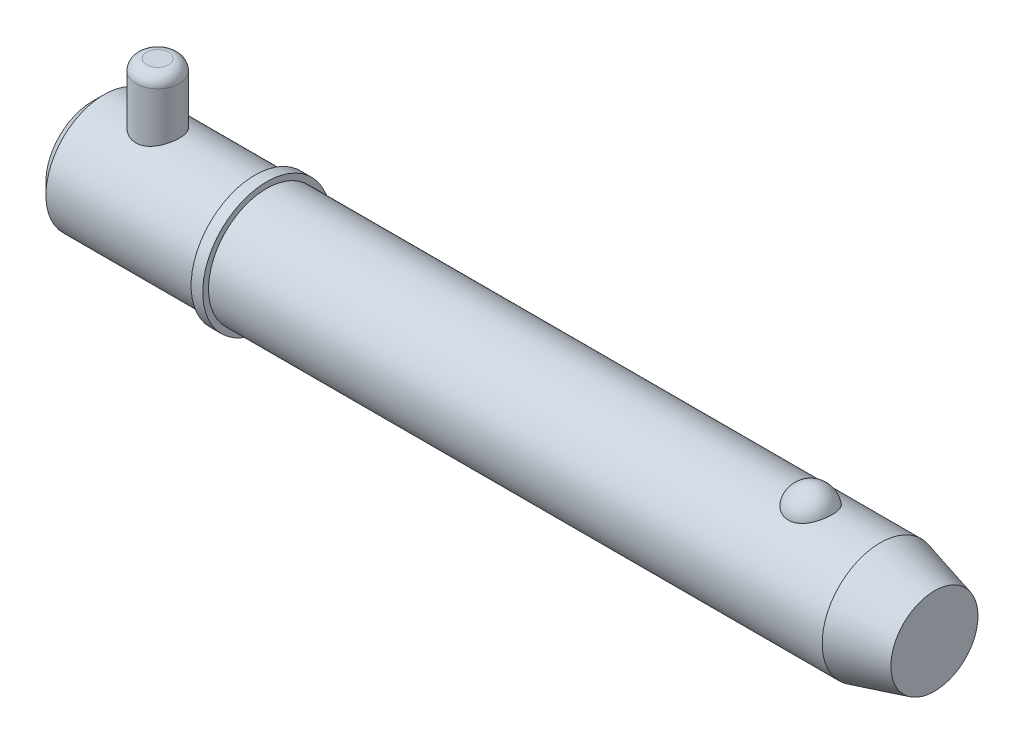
ISO-10303-21;
HEADER;
FILE_DESCRIPTION(('STEP AP214'),'2;1');
FILE_NAME('part.step','',(''),(''),'','','');
FILE_SCHEMA(('AUTOMOTIVE_DESIGN { 1 0 10303 214 1 1 1 1 }'));
ENDSEC;
DATA;
#1=APPLICATION_CONTEXT('core data for automotive mechanical design processes');
#2=APPLICATION_PROTOCOL_DEFINITION('international standard','automotive_design',2000,#1);
#3=PRODUCT_CONTEXT('',#1,'mechanical');
#4=PRODUCT('Part','Part','',(#3));
#5=PRODUCT_RELATED_PRODUCT_CATEGORY('part','',(#4));
#6=PRODUCT_DEFINITION_FORMATION('','',#4);
#7=PRODUCT_DEFINITION_CONTEXT('part definition',#1,'design');
#8=PRODUCT_DEFINITION('design','',#6,#7);
#9=PRODUCT_DEFINITION_SHAPE('','',#8);
#10=(LENGTH_UNIT() NAMED_UNIT(*) SI_UNIT(.MILLI.,.METRE.));
#11=(NAMED_UNIT(*) PLANE_ANGLE_UNIT() SI_UNIT($,.RADIAN.));
#12=(NAMED_UNIT(*) SI_UNIT($,.STERADIAN.) SOLID_ANGLE_UNIT());
#13=UNCERTAINTY_MEASURE_WITH_UNIT(LENGTH_MEASURE(1.E-05),#10,'distance_accuracy_value','');
#14=(GEOMETRIC_REPRESENTATION_CONTEXT(3) GLOBAL_UNCERTAINTY_ASSIGNED_CONTEXT((#13)) GLOBAL_UNIT_ASSIGNED_CONTEXT((#10,
#11,#12)) REPRESENTATION_CONTEXT('',''));
#15=CARTESIAN_POINT('',(0.,0.,0.));
#16=DIRECTION('',(0.,0.,1.));
#17=DIRECTION('',(1.,0.,0.));
#18=AXIS2_PLACEMENT_3D('',#15,#16,#17);
#19=CARTESIAN_POINT('',(14.28,25.4,0.));
#20=DIRECTION('',(0.,-1.,0.));
#21=DIRECTION('',(0.,0.,-1.));
#22=AXIS2_PLACEMENT_3D('',#19,#20,#21);
#23=CYLINDRICAL_SURFACE('',#22,4.76);
#24=CARTESIAN_POINT('',(14.28,-10.32,0.));
#25=DIRECTION('',(0.,1.,0.));
#26=DIRECTION('',(0.,0.,1.));
#27=AXIS2_PLACEMENT_3D('',#24,#25,#26);
#28=CIRCLE('',#27,4.76);
#29=CARTESIAN_POINT('',(14.28,-10.32,-4.76));
#30=VERTEX_POINT('',#29);
#31=EDGE_CURVE('P0_E25',#30,#30,#28,.T.);
#32=CARTESIAN_POINT('',(14.28,23.02,0.));
#33=DIRECTION('',(0.,1.,0.));
#34=DIRECTION('',(0.,0.,1.));
#35=AXIS2_PLACEMENT_3D('',#32,#33,#34);
#36=CIRCLE('',#35,4.76);
#37=CARTESIAN_POINT('',(14.28,23.02,-4.76));
#38=VERTEX_POINT('',#37);
#39=EDGE_CURVE('P0_E29',#38,#38,#36,.F.);
#40=CARTESIAN_POINT('',(14.28,-10.32,-4.76));
#41=CARTESIAN_POINT('',(14.28,-9.97270833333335,-4.76));
#42=CARTESIAN_POINT('',(14.28,-9.62541666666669,-4.76));
#43=CARTESIAN_POINT('',(14.28,-8.93083333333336,-4.76));
#44=CARTESIAN_POINT('',(14.28,-8.58354166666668,-4.76));
#45=CARTESIAN_POINT('',(14.28,-7.88895833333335,-4.76));
#46=CARTESIAN_POINT('',(14.28,-7.54166666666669,-4.76));
#47=CARTESIAN_POINT('',(14.28,-6.84708333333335,-4.76));
#48=CARTESIAN_POINT('',(14.28,-6.49979166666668,-4.76));
#49=CARTESIAN_POINT('',(14.28,-5.80520833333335,-4.76));
#50=CARTESIAN_POINT('',(14.28,-5.45791666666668,-4.76));
#51=CARTESIAN_POINT('',(14.28,-4.76333333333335,-4.76));
#52=CARTESIAN_POINT('',(14.28,-4.41604166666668,-4.76));
#53=CARTESIAN_POINT('',(14.28,-3.72145833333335,-4.76));
#54=CARTESIAN_POINT('',(14.28,-3.37416666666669,-4.76));
#55=CARTESIAN_POINT('',(14.28,-2.67958333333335,-4.76));
#56=CARTESIAN_POINT('',(14.28,-2.33229166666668,-4.76));
#57=CARTESIAN_POINT('',(14.28,-1.63770833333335,-4.76));
#58=CARTESIAN_POINT('',(14.28,-1.29041666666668,-4.76));
#59=CARTESIAN_POINT('',(14.28,-0.595833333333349,-4.76));
#60=CARTESIAN_POINT('',(14.28,-0.24854166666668,-4.76));
#61=CARTESIAN_POINT('',(14.28,0.446041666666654,-4.76));
#62=CARTESIAN_POINT('',(14.28,0.793333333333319,-4.76));
#63=CARTESIAN_POINT('',(14.28,1.48791666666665,-4.76));
#64=CARTESIAN_POINT('',(14.28,1.83520833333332,-4.76));
#65=CARTESIAN_POINT('',(14.28,2.52979166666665,-4.76));
#66=CARTESIAN_POINT('',(14.28,2.87708333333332,-4.76));
#67=CARTESIAN_POINT('',(14.28,3.57166666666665,-4.76));
#68=CARTESIAN_POINT('',(14.28,3.91895833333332,-4.76));
#69=CARTESIAN_POINT('',(14.28,4.61354166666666,-4.76));
#70=CARTESIAN_POINT('',(14.28,4.96083333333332,-4.76));
#71=CARTESIAN_POINT('',(14.28,5.65541666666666,-4.76));
#72=CARTESIAN_POINT('',(14.28,6.00270833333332,-4.76));
#73=CARTESIAN_POINT('',(14.28,6.69729166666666,-4.76));
#74=CARTESIAN_POINT('',(14.28,7.04458333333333,-4.76));
#75=CARTESIAN_POINT('',(14.28,7.73916666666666,-4.76));
#76=CARTESIAN_POINT('',(14.28,8.08645833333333,-4.76));
#77=CARTESIAN_POINT('',(14.28,8.78104166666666,-4.76));
#78=CARTESIAN_POINT('',(14.28,9.12833333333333,-4.76));
#79=CARTESIAN_POINT('',(14.28,9.82291666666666,-4.76));
#80=CARTESIAN_POINT('',(14.28,10.1702083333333,-4.76));
#81=CARTESIAN_POINT('',(14.28,10.8647916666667,-4.76));
#82=CARTESIAN_POINT('',(14.28,11.2120833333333,-4.76));
#83=CARTESIAN_POINT('',(14.28,11.9066666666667,-4.76));
#84=CARTESIAN_POINT('',(14.28,12.2539583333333,-4.76));
#85=CARTESIAN_POINT('',(14.28,12.9485416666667,-4.76));
#86=CARTESIAN_POINT('',(14.28,13.2958333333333,-4.76));
#87=CARTESIAN_POINT('',(14.28,13.9904166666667,-4.76));
#88=CARTESIAN_POINT('',(14.28,14.3377083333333,-4.76));
#89=CARTESIAN_POINT('',(14.28,15.0322916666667,-4.76));
#90=CARTESIAN_POINT('',(14.28,15.3795833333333,-4.76));
#91=CARTESIAN_POINT('',(14.28,16.0741666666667,-4.76));
#92=CARTESIAN_POINT('',(14.28,16.4214583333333,-4.76));
#93=CARTESIAN_POINT('',(14.28,17.1160416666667,-4.76));
#94=CARTESIAN_POINT('',(14.28,17.4633333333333,-4.76));
#95=CARTESIAN_POINT('',(14.28,18.1579166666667,-4.76));
#96=CARTESIAN_POINT('',(14.28,18.5052083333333,-4.76));
#97=CARTESIAN_POINT('',(14.28,19.1997916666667,-4.76));
#98=CARTESIAN_POINT('',(14.28,19.5470833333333,-4.76));
#99=CARTESIAN_POINT('',(14.28,20.2416666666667,-4.76));
#100=CARTESIAN_POINT('',(14.28,20.5889583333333,-4.76));
#101=CARTESIAN_POINT('',(14.28,21.2835416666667,-4.76));
#102=CARTESIAN_POINT('',(14.28,21.6308333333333,-4.76));
#103=CARTESIAN_POINT('',(14.28,22.3254166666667,-4.76));
#104=CARTESIAN_POINT('',(14.28,22.6727083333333,-4.76));
#105=CARTESIAN_POINT('',(14.28,23.02,-4.76));
#106=B_SPLINE_CURVE_WITH_KNOTS('',3,(#40,#41,#42,#43,#44,#45,#46,#47,#48,#49,#50,#51,#52,#53,
#54,#55,#56,#57,#58,#59,#60,#61,#62,#63,#64,#65,#66,#67,#68,#69,#70,#71,#72,#73,#74,#75,#76,#77,
#78,#79,#80,#81,#82,#83,#84,#85,#86,#87,#88,#89,#90,#91,#92,#93,#94,#95,#96,#97,#98,#99,#100,
#101,#102,#103,#104,#105),.UNSPECIFIED.,.F.,.F.,(4,2,2,2,2,2,2,2,2,2,2,2,2,2,2,2,2,2,2,2,2,2,2,
2,2,2,2,2,2,2,2,2,4),(0.,1.041875,2.08375,3.125625,4.1675,5.209375,6.25125,7.293125,
8.33500000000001,9.376875,10.41875,11.460625,12.5025,13.544375,14.58625,15.628125,16.67,
17.711875,18.75375,19.795625,20.8375,21.879375,22.92125,23.963125,25.005,26.046875,27.08875,
28.130625,29.1725,30.214375,31.25625,32.298125,33.34),.UNSPECIFIED.);
#107=EDGE_CURVE('P0_BSEAM14',#30,#38,#106,.T.);
#108=ORIENTED_EDGE('',*,*,#31,.T.);
#109=ORIENTED_EDGE('',*,*,#39,.T.);
#110=ORIENTED_EDGE('',*,*,#107,.T.);
#111=ORIENTED_EDGE('',*,*,#107,.F.);
#112=EDGE_LOOP('',(#108,#110,#109,#111));
#113=FACE_BOUND('',#112,.T.);
#114=ADVANCED_FACE('P0_F14',(#113),#23,.T.);
#115=CARTESIAN_POINT('',(14.28,25.4,0.));
#116=DIRECTION('',(0.,1.,0.));
#117=DIRECTION('',(0.,0.,1.));
#118=AXIS2_PLACEMENT_3D('',#115,#116,#117);
#119=PLANE('',#118);
#120=CARTESIAN_POINT('',(14.28,25.4,0.));
#121=DIRECTION('',(0.,1.,0.));
#122=DIRECTION('',(0.,0.,1.));
#123=AXIS2_PLACEMENT_3D('',#120,#121,#122);
#124=CIRCLE('',#123,2.38);
#125=CARTESIAN_POINT('',(14.28,25.4,2.38));
#126=VERTEX_POINT('',#125);
#127=EDGE_CURVE('P0_E10',#126,#126,#124,.T.);
#128=ORIENTED_EDGE('',*,*,#127,.T.);
#129=EDGE_LOOP('',(#128));
#130=FACE_BOUND('',#129,.T.);
#131=ADVANCED_FACE('P0_F46',(#130),#119,.T.);
#132=CARTESIAN_POINT('',(14.28,-12.7,0.));
#133=DIRECTION('',(0.,1.,0.));
#134=DIRECTION('',(0.,0.,1.));
#135=AXIS2_PLACEMENT_3D('',#132,#133,#134);
#136=PLANE('',#135);
#137=CARTESIAN_POINT('',(14.28,-12.7,0.));
#138=DIRECTION('',(0.,1.,0.));
#139=DIRECTION('',(0.,0.,1.));
#140=AXIS2_PLACEMENT_3D('',#137,#138,#139);
#141=CIRCLE('',#140,2.38);
#142=CARTESIAN_POINT('',(14.28,-12.7,2.38));
#143=VERTEX_POINT('',#142);
#144=EDGE_CURVE('P0_E21',#143,#143,#141,.F.);
#145=ORIENTED_EDGE('',*,*,#144,.T.);
#146=EDGE_LOOP('',(#145));
#147=FACE_BOUND('',#146,.T.);
#148=ADVANCED_FACE('P0_F43',(#147),#136,.F.);
#149=CARTESIAN_POINT('',(14.28,-10.32,0.));
#150=DIRECTION('',(0.,1.,0.));
#151=DIRECTION('',(0.,0.,1.));
#152=AXIS2_PLACEMENT_3D('',#149,#150,#151);
#153=DEGENERATE_TOROIDAL_SURFACE('',#152,2.38,2.38,.T.);
#154=ORIENTED_EDGE('',*,*,#144,.F.);
#155=EDGE_LOOP('',(#154));
#156=FACE_BOUND('',#155,.T.);
#157=ORIENTED_EDGE('',*,*,#31,.F.);
#158=EDGE_LOOP('',(#157));
#159=FACE_BOUND('',#158,.T.);
#160=ADVANCED_FACE('P0_F38',(#156,#159),#153,.T.);
#161=CARTESIAN_POINT('',(14.28,23.02,0.));
#162=DIRECTION('',(0.,1.,0.));
#163=DIRECTION('',(0.,0.,1.));
#164=AXIS2_PLACEMENT_3D('',#161,#162,#163);
#165=DEGENERATE_TOROIDAL_SURFACE('',#164,2.38,2.38,.T.);
#166=ORIENTED_EDGE('',*,*,#39,.F.);
#167=EDGE_LOOP('',(#166));
#168=FACE_BOUND('',#167,.T.);
#169=ORIENTED_EDGE('',*,*,#127,.F.);
#170=EDGE_LOOP('',(#169));
#171=FACE_BOUND('',#170,.T.);
#172=ADVANCED_FACE('P0_F16',(#168,#171),#165,.T.);
#173=CLOSED_SHELL('',(#114,#131,#148,#160,#172));
#174=MANIFOLD_SOLID_BREP('P0_B1',#173);
#175=CARTESIAN_POINT('',(0.,0.,0.));
#176=DIRECTION('',(1.,0.,0.));
#177=DIRECTION('',(0.,0.,-1.));
#178=AXIS2_PLACEMENT_3D('',#175,#176,#177);
#179=CYLINDRICAL_SURFACE('',#178,12.7);
#180=CARTESIAN_POINT('',(172.300738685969,0.,0.));
#181=DIRECTION('',(1.,0.,0.));
#182=DIRECTION('',(0.,0.,-1.));
#183=AXIS2_PLACEMENT_3D('',#180,#181,#182);
#184=CIRCLE('',#183,12.7);
#185=CARTESIAN_POINT('',(172.300738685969,0.,-12.7));
#186=VERTEX_POINT('',#185);
#187=EDGE_CURVE('P1_E81',#186,#186,#184,.T.);
#188=ORIENTED_EDGE('',*,*,#187,.F.);
#189=EDGE_LOOP('',(#188));
#190=FACE_BOUND('',#189,.T.);
#191=CARTESIAN_POINT('',(38.1,0.,0.));
#192=DIRECTION('',(1.,0.,0.));
#193=DIRECTION('',(0.,0.,-1.));
#194=AXIS2_PLACEMENT_3D('',#191,#192,#193);
#195=CIRCLE('',#194,12.7);
#196=CARTESIAN_POINT('',(38.1,0.,-12.7));
#197=VERTEX_POINT('',#196);
#198=EDGE_CURVE('P1_E85',#197,#197,#195,.T.);
#199=ORIENTED_EDGE('',*,*,#198,.T.);
#200=EDGE_LOOP('',(#199));
#201=FACE_BOUND('',#200,.T.);
#202=CARTESIAN_POINT('',(157.060042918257,11.7500437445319,4.81938502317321));
#203=CARTESIAN_POINT('',(156.935088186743,11.7500430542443,4.81938571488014));
#204=CARTESIAN_POINT('',(156.810144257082,11.7520975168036,4.81438658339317));
#205=CARTESIAN_POINT('',(156.561142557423,11.760253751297,4.7944290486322));
#206=CARTESIAN_POINT('',(156.437085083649,11.7663568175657,4.77946746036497));
#207=CARTESIAN_POINT('',(156.190901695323,11.7824262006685,4.73971414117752));
#208=CARTESIAN_POINT('',(156.068774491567,11.7923898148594,4.71492928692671));
#209=CARTESIAN_POINT('',(155.827187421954,11.8158938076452,4.65571340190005));
#210=CARTESIAN_POINT('',(155.70772859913,11.8294355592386,4.62127866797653));
#211=CARTESIAN_POINT('',(155.472557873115,11.8596812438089,4.5430950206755));
#212=CARTESIAN_POINT('',(155.356839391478,11.8763792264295,4.49936361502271));
#213=CARTESIAN_POINT('',(155.129653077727,11.9124878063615,4.40287235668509));
#214=CARTESIAN_POINT('',(155.018186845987,11.9318994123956,4.35010914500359));
#215=CARTESIAN_POINT('',(154.691278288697,11.9934256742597,4.17881316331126));
#216=CARTESIAN_POINT('',(154.483127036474,12.038858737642,4.04720756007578));
#217=CARTESIAN_POINT('',(154.085850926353,12.1352173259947,3.74856446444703));
#218=CARTESIAN_POINT('',(153.897443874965,12.1862630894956,3.58061821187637));
#219=CARTESIAN_POINT('',(153.550521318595,12.2875163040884,3.21600758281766));
#220=CARTESIAN_POINT('',(153.392011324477,12.3377235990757,3.01933792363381));
#221=CARTESIAN_POINT('',(153.10168878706,12.434492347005,2.59291655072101));
#222=CARTESIAN_POINT('',(152.971376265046,12.4807925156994,2.36208286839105));
#223=CARTESIAN_POINT('',(152.749407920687,12.5623454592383,1.88070399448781));
#224=CARTESIAN_POINT('',(152.657755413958,12.5975972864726,1.63015711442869));
#225=CARTESIAN_POINT('',(152.514046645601,12.6538414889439,1.11298869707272));
#226=CARTESIAN_POINT('',(152.462499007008,12.6746503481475,0.846205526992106));
#227=CARTESIAN_POINT('',(152.401977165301,12.699153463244,0.307085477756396));
#228=CARTESIAN_POINT('',(152.393001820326,12.7028481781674,0.0347487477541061));
#229=CARTESIAN_POINT('',(152.417731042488,12.6927785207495,-0.506073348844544));
#230=CARTESIAN_POINT('',(152.451189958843,12.6791146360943,-0.774571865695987));
#231=CARTESIAN_POINT('',(152.559687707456,12.635882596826,-1.30170246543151));
#232=CARTESIAN_POINT('',(152.63472729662,12.606314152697,-1.5603343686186));
#233=CARTESIAN_POINT('',(152.82500006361,12.5342328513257,-2.06083899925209));
#234=CARTESIAN_POINT('',(152.940287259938,12.4917026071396,-2.30268867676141));
#235=CARTESIAN_POINT('',(153.208704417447,12.3981123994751,-2.76259600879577));
#236=CARTESIAN_POINT('',(153.361837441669,12.3470517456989,-2.98065173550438));
#237=CARTESIAN_POINT('',(153.703507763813,12.2416045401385,-3.38786328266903));
#238=CARTESIAN_POINT('',(153.892201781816,12.1872040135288,-3.57688418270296));
#239=CARTESIAN_POINT('',(154.300239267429,12.0814086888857,-3.91941073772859));
#240=CARTESIAN_POINT('',(154.519580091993,12.0300136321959,-4.07291945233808));
#241=CARTESIAN_POINT('',(154.978375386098,11.9373542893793,-4.3369128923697));
#242=CARTESIAN_POINT('',(155.217304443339,11.8958982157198,-4.4482412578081));
#243=CARTESIAN_POINT('',(155.71243761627,11.8268116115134,-4.62881985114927));
#244=CARTESIAN_POINT('',(155.968635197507,11.7991758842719,-4.69808589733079));
#245=CARTESIAN_POINT('',(156.477164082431,11.7622209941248,-4.7898318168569));
#246=CARTESIAN_POINT('',(156.729041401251,11.7520502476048,-4.81449025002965));
#247=CARTESIAN_POINT('',(157.233573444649,11.7485796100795,-4.82295735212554));
#248=CARTESIAN_POINT('',(157.486228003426,11.7552763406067,-4.80677420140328));
#249=CARTESIAN_POINT('',(157.976834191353,11.7842584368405,-4.73525430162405));
#250=CARTESIAN_POINT('',(158.214998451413,11.8060486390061,-4.68116061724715));
#251=CARTESIAN_POINT('',(158.678489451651,11.8622750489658,-4.53678133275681));
#252=CARTESIAN_POINT('',(158.903815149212,11.8967122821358,-4.44649279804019));
#253=CARTESIAN_POINT('',(159.340801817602,11.9754603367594,-4.22987613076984));
#254=CARTESIAN_POINT('',(159.552057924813,12.0199699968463,-4.1028053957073));
#255=CARTESIAN_POINT('',(159.950601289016,12.1138028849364,-3.81685409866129));
#256=CARTESIAN_POINT('',(160.137883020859,12.163127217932,-3.65796622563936));
#257=CARTESIAN_POINT('',(160.493350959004,12.2642343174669,-3.30364864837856));
#258=CARTESIAN_POINT('',(160.660111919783,12.3160165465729,-3.10678783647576));
#259=CARTESIAN_POINT('',(160.959579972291,12.4142566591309,-2.68748409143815));
#260=CARTESIAN_POINT('',(161.092280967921,12.4607135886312,-2.46503658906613));
#261=CARTESIAN_POINT('',(161.324691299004,12.5450236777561,-1.99289519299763));
#262=CARTESIAN_POINT('',(161.423215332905,12.5825557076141,-1.74255918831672));
#263=CARTESIAN_POINT('',(161.579227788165,12.6431720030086,-1.22773734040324));
#264=CARTESIAN_POINT('',(161.636715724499,12.6662560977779,-0.963251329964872));
#265=CARTESIAN_POINT('',(161.709544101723,12.6956486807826,-0.42735507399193));
#266=CARTESIAN_POINT('',(161.724837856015,12.7019385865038,-0.155937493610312));
#267=CARTESIAN_POINT('',(161.712779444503,12.6970201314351,0.385928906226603));
#268=CARTESIAN_POINT('',(161.68542805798,12.6858120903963,0.656377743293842));
#269=CARTESIAN_POINT('',(161.613060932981,12.6568455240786,1.0545401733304));
#270=CARTESIAN_POINT('',(161.583796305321,12.6451962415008,1.18577850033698));
#271=CARTESIAN_POINT('',(161.515022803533,12.6181819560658,1.44513808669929));
#272=CARTESIAN_POINT('',(161.475517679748,12.6028183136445,1.57326046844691));
#273=CARTESIAN_POINT('',(161.386439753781,12.5687547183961,1.82554978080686));
#274=CARTESIAN_POINT('',(161.336862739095,12.5500533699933,1.9497150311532));
#275=CARTESIAN_POINT('',(161.22792115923,12.5098093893,2.19314370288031));
#276=CARTESIAN_POINT('',(161.168560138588,12.4882677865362,2.31240887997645));
#277=CARTESIAN_POINT('',(161.03997128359,12.4427679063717,2.54593031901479));
#278=CARTESIAN_POINT('',(160.970688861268,12.4187964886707,2.66015396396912));
#279=CARTESIAN_POINT('',(160.822903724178,12.3691892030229,2.88202659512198));
#280=CARTESIAN_POINT('',(160.744404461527,12.3435539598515,2.98967802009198));
#281=CARTESIAN_POINT('',(160.578550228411,12.2912955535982,3.19774385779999));
#282=CARTESIAN_POINT('',(160.491191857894,12.2646720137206,3.298155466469));
#283=CARTESIAN_POINT('',(160.308161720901,12.2111945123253,3.49095035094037));
#284=CARTESIAN_POINT('',(160.212493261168,12.1843406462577,3.58333679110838));
#285=CARTESIAN_POINT('',(160.013627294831,12.1312249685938,3.75922876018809));
#286=CARTESIAN_POINT('',(159.910450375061,12.104961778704,3.84275713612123));
#287=CARTESIAN_POINT('',(159.69701336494,12.0537284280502,4.00056406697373));
#288=CARTESIAN_POINT('',(159.586756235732,12.028757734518,4.07484645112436));
#289=CARTESIAN_POINT('',(159.359755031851,11.9808306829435,4.21367959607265));
#290=CARTESIAN_POINT('',(159.243006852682,11.9578756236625,4.27822410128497));
#291=CARTESIAN_POINT('',(159.00394258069,11.9147184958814,4.39698483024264));
#292=CARTESIAN_POINT('',(158.881628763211,11.894515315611,4.45120522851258));
#293=CARTESIAN_POINT('',(158.622952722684,11.8561129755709,4.55255353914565));
#294=CARTESIAN_POINT('',(158.486223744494,11.8381764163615,4.59884858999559));
#295=CARTESIAN_POINT('',(158.208608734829,11.8069093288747,4.67853897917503));
#296=CARTESIAN_POINT('',(158.067724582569,11.7935767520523,4.71194005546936));
#297=CARTESIAN_POINT('',(157.78309446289,11.7720277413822,4.76552188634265));
#298=CARTESIAN_POINT('',(157.639348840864,11.7638106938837,4.78570422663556));
#299=CARTESIAN_POINT('',(157.350411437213,11.7528195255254,4.81263433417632));
#300=CARTESIAN_POINT('',(157.205219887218,11.7500445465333,4.81938421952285));
#301=CARTESIAN_POINT('',(157.060042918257,11.7500437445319,4.81938502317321));
#302=B_SPLINE_CURVE_WITH_KNOTS('',3,(#202,#203,#204,#205,#206,#207,#208,#209,#210,#211,#212,
#213,#214,#215,#216,#217,#218,#219,#220,#221,#222,#223,#224,#225,#226,#227,#228,#229,#230,#231,
#232,#233,#234,#235,#236,#237,#238,#239,#240,#241,#242,#243,#244,#245,#246,#247,#248,#249,#250,
#251,#252,#253,#254,#255,#256,#257,#258,#259,#260,#261,#262,#263,#264,#265,#266,#267,#268,#269,
#270,#271,#272,#273,#274,#275,#276,#277,#278,#279,#280,#281,#282,#283,#284,#285,#286,#287,#288,
#289,#290,#291,#292,#293,#294,#295,#296,#297,#298,#299,#300,#301),.UNSPECIFIED.,.T.,.F.,(4,2,2,
2,2,2,2,2,2,2,2,2,2,2,2,2,2,2,2,2,2,2,2,2,2,2,2,2,2,2,2,2,2,2,2,2,2,2,2,2,2,2,2,2,2,2,2,2,2,4),
(0.,0.374729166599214,0.749578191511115,1.12416526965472,1.49889629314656,1.87292776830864,
2.24709865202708,2.99481328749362,3.76399449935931,4.53331735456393,5.33683915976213,
6.14042986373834,6.95405296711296,7.76765424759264,8.57656703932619,9.38549455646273,
10.1955119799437,11.0055949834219,11.8193353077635,12.633005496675,13.4294141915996,
14.2255231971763,14.9815786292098,15.7374826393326,16.4696948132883,17.2019663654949,
17.9501979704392,18.6986017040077,19.4844704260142,20.2704797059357,21.0815215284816,
21.8925729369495,22.7045213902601,23.5164550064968,23.9209608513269,24.3253187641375,
24.7298461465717,25.1342272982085,25.5409255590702,25.9474719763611,26.3541750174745,
26.7607169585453,27.1661834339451,27.5714814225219,27.9770386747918,28.3824315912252,
28.8181206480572,29.2536155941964,29.6890582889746,30.1244323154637),.UNSPECIFIED.);
#303=CARTESIAN_POINT('',(157.060042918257,11.7500437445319,4.81938502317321));
#304=VERTEX_POINT('',#303);
#305=EDGE_CURVE('P1_E35',#304,#304,#302,.T.);
#306=ORIENTED_EDGE('',*,*,#305,.T.);
#307=EDGE_LOOP('',(#306));
#308=FACE_BOUND('',#307,.T.);
#309=ADVANCED_FACE('P1_F13',(#190,#201,#308),#179,.T.);
#310=CARTESIAN_POINT('',(0.,0.,0.));
#311=DIRECTION('',(-1.,0.,0.));
#312=DIRECTION('',(0.,0.,1.));
#313=AXIS2_PLACEMENT_3D('',#310,#311,#312);
#314=PLANE('',#313);
#315=CARTESIAN_POINT('',(0.,0.,0.));
#316=DIRECTION('',(1.,0.,0.));
#317=DIRECTION('',(0.,0.,-1.));
#318=AXIS2_PLACEMENT_3D('',#315,#316,#317);
#319=CIRCLE('',#318,10.16);
#320=CARTESIAN_POINT('',(0.,0.,-10.16));
#321=VERTEX_POINT('',#320);
#322=EDGE_CURVE('P1_E9',#321,#321,#319,.T.);
#323=ORIENTED_EDGE('',*,*,#322,.F.);
#324=EDGE_LOOP('',(#323));
#325=FACE_BOUND('',#324,.T.);
#326=ADVANCED_FACE('P1_F15',(#325),#314,.T.);
#327=CARTESIAN_POINT('',(2.53999999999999,0.,0.));
#328=DIRECTION('',(1.,0.,0.));
#329=DIRECTION('',(0.,0.,-1.));
#330=AXIS2_PLACEMENT_3D('',#327,#328,#329);
#331=CONICAL_SURFACE('',#330,12.7,0.78539816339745);
#332=ORIENTED_EDGE('',*,*,#322,.T.);
#333=EDGE_LOOP('',(#332));
#334=FACE_BOUND('',#333,.T.);
#335=CARTESIAN_POINT('',(2.53999999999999,0.,0.));
#336=DIRECTION('',(1.,0.,0.));
#337=DIRECTION('',(0.,0.,-1.));
#338=AXIS2_PLACEMENT_3D('',#335,#336,#337);
#339=CIRCLE('',#338,12.7);
#340=CARTESIAN_POINT('',(2.53999999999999,0.,-12.7));
#341=VERTEX_POINT('',#340);
#342=EDGE_CURVE('P1_E26',#341,#341,#339,.T.);
#343=ORIENTED_EDGE('',*,*,#342,.F.);
#344=EDGE_LOOP('',(#343));
#345=FACE_BOUND('',#344,.T.);
#346=ADVANCED_FACE('P1_F77',(#334,#345),#331,.T.);
#347=CARTESIAN_POINT('',(0.,0.,0.));
#348=DIRECTION('',(1.,0.,0.));
#349=DIRECTION('',(0.,0.,-1.));
#350=AXIS2_PLACEMENT_3D('',#347,#348,#349);
#351=CYLINDRICAL_SURFACE('',#350,12.7);
#352=CARTESIAN_POINT('',(14.28,-11.7742260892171,4.76));
#353=CARTESIAN_POINT('',(14.1514948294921,-11.7742255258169,4.76000061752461));
#354=CARTESIAN_POINT('',(14.0229980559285,-11.7763355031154,4.75479194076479));
#355=CARTESIAN_POINT('',(13.7669369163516,-11.7847043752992,4.73401198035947));
#356=CARTESIAN_POINT('',(13.6393728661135,-11.7909646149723,4.71843733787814));
#357=CARTESIAN_POINT('',(13.386226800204,-11.8074248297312,4.67709434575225));
#358=CARTESIAN_POINT('',(13.2606439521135,-11.8176231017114,4.65133040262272));
#359=CARTESIAN_POINT('',(13.0122434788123,-11.8416347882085,4.58985545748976));
#360=CARTESIAN_POINT('',(12.8894269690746,-11.8554496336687,4.55414051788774));
#361=CARTESIAN_POINT('',(12.6477622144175,-11.8862222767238,4.47320764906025));
#362=CARTESIAN_POINT('',(12.5289037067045,-11.9031710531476,4.4280169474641));
#363=CARTESIAN_POINT('',(12.2955059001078,-11.939736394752,4.32845291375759));
#364=CARTESIAN_POINT('',(12.1809682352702,-11.9593539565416,4.2740761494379));
#365=CARTESIAN_POINT('',(11.8448901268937,-12.0213893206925,4.09777237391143));
#366=CARTESIAN_POINT('',(11.6307077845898,-12.0670135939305,3.9626122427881));
#367=CARTESIAN_POINT('',(11.2179129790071,-12.1641514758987,3.65386230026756));
#368=CARTESIAN_POINT('',(11.0204399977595,-12.2158379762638,3.47881300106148));
#369=CARTESIAN_POINT('',(10.6568212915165,-12.3178468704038,3.09829182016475));
#370=CARTESIAN_POINT('',(10.4906822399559,-12.3681689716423,2.89281347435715));
#371=CARTESIAN_POINT('',(10.1890299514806,-12.4638367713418,2.44867909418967));
#372=CARTESIAN_POINT('',(10.054749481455,-12.5089552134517,2.20913281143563));
#373=CARTESIAN_POINT('',(9.82886079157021,-12.5870472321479,1.70885919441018));
#374=CARTESIAN_POINT('',(9.73723778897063,-12.620025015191,1.44813923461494));
#375=CARTESIAN_POINT('',(9.60324488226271,-12.6688874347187,0.9248423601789));
#376=CARTESIAN_POINT('',(9.55892269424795,-12.6854474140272,0.662829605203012));
#377=CARTESIAN_POINT('',(9.5145335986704,-12.7020320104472,0.134596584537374));
#378=CARTESIAN_POINT('',(9.5144523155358,-12.7020619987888,-0.131622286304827));
#379=CARTESIAN_POINT('',(9.55741019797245,-12.6860129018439,-0.646717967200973));
#380=CARTESIAN_POINT('',(9.59831845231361,-12.6707298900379,-0.895801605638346));
#381=CARTESIAN_POINT('',(9.71850987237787,-12.6268158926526,-1.38327219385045));
#382=CARTESIAN_POINT('',(9.79779575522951,-12.5981839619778,-1.62165838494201));
#383=CARTESIAN_POINT('',(9.99348296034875,-12.5298894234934,-2.08508424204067));
#384=CARTESIAN_POINT('',(10.110407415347,-12.4900724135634,-2.30987931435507));
#385=CARTESIAN_POINT('',(10.3775896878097,-12.4034373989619,-2.7372158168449));
#386=CARTESIAN_POINT('',(10.5278582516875,-12.3566171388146,-2.93975004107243));
#387=CARTESIAN_POINT('',(10.8677318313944,-12.257571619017,-3.32936830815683));
#388=CARTESIAN_POINT('',(11.0591227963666,-12.2051903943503,-3.51485714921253));
#389=CARTESIAN_POINT('',(11.4706087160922,-12.1031155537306,-3.85170663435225));
#390=CARTESIAN_POINT('',(11.6907108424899,-12.0534226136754,-4.00305872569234));
#391=CARTESIAN_POINT('',(12.1596597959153,-11.9613684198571,-4.27038218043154));
#392=CARTESIAN_POINT('',(12.4090353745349,-11.9191939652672,-4.38549550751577));
#393=CARTESIAN_POINT('',(12.9256290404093,-11.8491124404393,-4.57149117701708));
#394=CARTESIAN_POINT('',(13.1928371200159,-11.8211974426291,-4.64239810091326));
#395=CARTESIAN_POINT('',(13.7217488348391,-11.7846654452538,-4.73434137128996));
#396=CARTESIAN_POINT('',(13.9829438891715,-11.7750694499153,-4.75791141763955));
#397=CARTESIAN_POINT('',(14.5056760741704,-11.7734909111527,-4.76182097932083));
#398=CARTESIAN_POINT('',(14.7672131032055,-11.7815039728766,-4.74217128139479));
#399=CARTESIAN_POINT('',(15.2702140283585,-11.8132466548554,-4.66249544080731));
#400=CARTESIAN_POINT('',(15.5120417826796,-11.8362133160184,-4.60442726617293));
#401=CARTESIAN_POINT('',(15.9824097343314,-11.8943704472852,-4.45202868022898));
#402=CARTESIAN_POINT('',(16.2109472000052,-11.9295634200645,-4.35769084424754));
#403=CARTESIAN_POINT('',(16.6577741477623,-12.0098310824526,-4.13144368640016));
#404=CARTESIAN_POINT('',(16.8753590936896,-12.055226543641,-3.99825937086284));
#405=CARTESIAN_POINT('',(17.2859732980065,-12.150238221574,-3.69949845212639));
#406=CARTESIAN_POINT('',(17.4789935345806,-12.19985597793,-3.5339100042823));
#407=CARTESIAN_POINT('',(17.8477707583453,-12.3015434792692,-3.1624728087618));
#408=CARTESIAN_POINT('',(18.0216609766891,-12.3535695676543,-2.95473880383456));
#409=CARTESIAN_POINT('',(18.254545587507,-12.426745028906,-2.62277433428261));
#410=CARTESIAN_POINT('',(18.3275489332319,-12.4503382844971,-2.50865480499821));
#411=CARTESIAN_POINT('',(18.463723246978,-12.4952713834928,-2.27428971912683));
#412=CARTESIAN_POINT('',(18.5268984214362,-12.5166121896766,-2.15404681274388));
#413=CARTESIAN_POINT('',(18.6427140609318,-12.5563817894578,-1.90858448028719));
#414=CARTESIAN_POINT('',(18.6953855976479,-12.5748191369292,-1.78338108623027));
#415=CARTESIAN_POINT('',(18.7899337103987,-12.6083284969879,-1.52857834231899));
#416=CARTESIAN_POINT('',(18.8318147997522,-12.6234019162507,-1.39898085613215));
#417=CARTESIAN_POINT('',(18.9043819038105,-12.6497495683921,-1.13633254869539));
#418=CARTESIAN_POINT('',(18.9350698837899,-12.6610244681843,-1.00328233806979));
#419=CARTESIAN_POINT('',(18.9849303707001,-12.6794412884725,-0.734761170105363));
#420=CARTESIAN_POINT('',(19.0041035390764,-12.6865834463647,-0.59929035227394));
#421=CARTESIAN_POINT('',(19.0299427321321,-12.6962286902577,-0.335006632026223));
#422=CARTESIAN_POINT('',(19.0372742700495,-12.698978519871,-0.206267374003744));
#423=CARTESIAN_POINT('',(19.0414668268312,-12.7005496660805,0.0514515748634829));
#424=CARTESIAN_POINT('',(19.038324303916,-12.69936965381,0.180431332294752));
#425=CARTESIAN_POINT('',(19.0215965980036,-12.6931114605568,0.437551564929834));
#426=CARTESIAN_POINT('',(19.0080165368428,-12.6880351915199,0.565692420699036));
#427=CARTESIAN_POINT('',(18.9705519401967,-12.6741222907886,0.820297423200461));
#428=CARTESIAN_POINT('',(18.9466635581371,-12.665284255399,0.946760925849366));
#429=CARTESIAN_POINT('',(18.8895279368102,-12.6443449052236,1.19395899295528));
#430=CARTESIAN_POINT('',(18.8565273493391,-12.6323299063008,1.3147578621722));
#431=CARTESIAN_POINT('',(18.781239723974,-12.6052503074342,1.55308888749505));
#432=CARTESIAN_POINT('',(18.738949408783,-12.5901846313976,1.67061987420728));
#433=CARTESIAN_POINT('',(18.5986461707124,-12.5409473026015,2.01714406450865));
#434=CARTESIAN_POINT('',(18.4871532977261,-12.502717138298,2.24027279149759));
#435=CARTESIAN_POINT('',(18.2262440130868,-12.4173042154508,2.6742599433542));
#436=CARTESIAN_POINT('',(18.0754310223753,-12.3698127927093,2.88420891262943));
#437=CARTESIAN_POINT('',(17.7421836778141,-12.271667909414,3.27675114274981));
#438=CARTESIAN_POINT('',(17.5597380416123,-12.2210133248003,3.45933459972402));
#439=CARTESIAN_POINT('',(17.2605468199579,-12.1452079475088,3.7138066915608));
#440=CARTESIAN_POINT('',(17.1535518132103,-12.119328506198,3.79719993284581));
#441=CARTESIAN_POINT('',(16.9326449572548,-12.0688597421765,3.95467398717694));
#442=CARTESIAN_POINT('',(16.8187356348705,-12.0442699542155,4.02875817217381));
#443=CARTESIAN_POINT('',(16.5846234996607,-11.9971053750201,4.16711104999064));
#444=CARTESIAN_POINT('',(16.4644172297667,-11.9745317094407,4.23137427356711));
#445=CARTESIAN_POINT('',(16.2185866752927,-11.9321360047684,4.34949041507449));
#446=CARTESIAN_POINT('',(16.09296473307,-11.9123127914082,4.40334777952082));
#447=CARTESIAN_POINT('',(15.8314769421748,-11.875268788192,4.50232278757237));
#448=CARTESIAN_POINT('',(15.6954035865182,-11.8582009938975,4.54695127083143));
#449=CARTESIAN_POINT('',(15.4194002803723,-11.8284328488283,4.62383807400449));
#450=CARTESIAN_POINT('',(15.2794720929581,-11.815730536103,4.6561019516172));
#451=CARTESIAN_POINT('',(14.9969657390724,-11.7951940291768,4.70788444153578));
#452=CARTESIAN_POINT('',(14.8543884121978,-11.7873583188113,4.72740702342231));
#453=CARTESIAN_POINT('',(14.5678704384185,-11.7768749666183,4.75346370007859));
#454=CARTESIAN_POINT('',(14.4239299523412,-11.7742267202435,4.75999930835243));
#455=CARTESIAN_POINT('',(14.28,-11.7742260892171,4.76));
#456=B_SPLINE_CURVE_WITH_KNOTS('',3,(#352,#353,#354,#355,#356,#357,#358,#359,#360,#361,#362,
#363,#364,#365,#366,#367,#368,#369,#370,#371,#372,#373,#374,#375,#376,#377,#378,#379,#380,#381,
#382,#383,#384,#385,#386,#387,#388,#389,#390,#391,#392,#393,#394,#395,#396,#397,#398,#399,#400,
#401,#402,#403,#404,#405,#406,#407,#408,#409,#410,#411,#412,#413,#414,#415,#416,#417,#418,#419,
#420,#421,#422,#423,#424,#425,#426,#427,#428,#429,#430,#431,#432,#433,#434,#435,#436,#437,#438,
#439,#440,#441,#442,#443,#444,#445,#446,#447,#448,#449,#450,#451,#452,#453,#454,#455),
.UNSPECIFIED.,.T.,.F.,(4,2,2,2,2,2,2,2,2,2,2,2,2,2,2,2,2,2,2,2,2,2,2,2,2,2,2,2,2,2,2,2,2,2,2,2,
2,2,2,2,2,2,2,2,2,2,2,2,2,2,2,4),(0.,0.385378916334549,0.770882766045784,1.15622008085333,
1.54171009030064,1.92610725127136,2.31064835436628,3.07917291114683,3.88239385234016,
4.68578566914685,5.51648193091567,6.34689010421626,7.14151420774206,7.93588010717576,
8.69098665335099,9.44614666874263,10.2122918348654,10.9786842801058,11.789876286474,
12.6012713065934,13.4306405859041,14.2595482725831,15.0427613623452,15.8257790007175,
16.5716820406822,17.3177378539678,18.0917395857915,18.8660247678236,19.6893332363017,
20.1014571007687,20.5134040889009,20.9241137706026,21.3346513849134,21.7451168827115,
22.1555587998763,22.542011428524,22.928594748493,23.3149884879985,23.7015265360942,
24.0784835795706,24.4555738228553,25.2091300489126,25.994347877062,26.7798463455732,
27.1937428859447,27.6074890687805,28.0214648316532,28.4352633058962,28.8672794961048,
29.299101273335,29.7307884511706,30.1624253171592),.UNSPECIFIED.);
#457=CARTESIAN_POINT('',(14.28,-11.7742260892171,4.76));
#458=VERTEX_POINT('',#457);
#459=EDGE_CURVE('P1_E17',#458,#458,#456,.T.);
#460=ORIENTED_EDGE('',*,*,#459,.F.);
#461=EDGE_LOOP('',(#460));
#462=FACE_BOUND('',#461,.T.);
#463=CARTESIAN_POINT('',(14.28,11.7742260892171,4.76));
#464=CARTESIAN_POINT('',(14.4085051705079,11.7742255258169,4.76000061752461));
#465=CARTESIAN_POINT('',(14.5370019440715,11.7763355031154,4.75479194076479));
#466=CARTESIAN_POINT('',(14.7930630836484,11.7847043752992,4.73401198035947));
#467=CARTESIAN_POINT('',(14.9206271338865,11.7909646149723,4.71843733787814));
#468=CARTESIAN_POINT('',(15.173773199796,11.8074248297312,4.67709434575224));
#469=CARTESIAN_POINT('',(15.2993560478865,11.8176231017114,4.65133040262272));
#470=CARTESIAN_POINT('',(15.5477565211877,11.8416347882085,4.58985545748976));
#471=CARTESIAN_POINT('',(15.6705730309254,11.8554496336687,4.55414051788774));
#472=CARTESIAN_POINT('',(15.9122377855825,11.8862222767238,4.47320764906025));
#473=CARTESIAN_POINT('',(16.0310962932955,11.9031710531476,4.4280169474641));
#474=CARTESIAN_POINT('',(16.2644940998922,11.939736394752,4.32845291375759));
#475=CARTESIAN_POINT('',(16.3790317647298,11.9593539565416,4.2740761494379));
#476=CARTESIAN_POINT('',(16.7151098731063,12.0213893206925,4.09777237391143));
#477=CARTESIAN_POINT('',(16.9292922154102,12.0670135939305,3.96261224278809));
#478=CARTESIAN_POINT('',(17.3420870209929,12.1641514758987,3.65386230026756));
#479=CARTESIAN_POINT('',(17.5395600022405,12.2158379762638,3.47881300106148));
#480=CARTESIAN_POINT('',(17.9031787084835,12.3178468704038,3.09829182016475));
#481=CARTESIAN_POINT('',(18.0693177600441,12.3681689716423,2.89281347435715));
#482=CARTESIAN_POINT('',(18.3709700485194,12.4638367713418,2.44867909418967));
#483=CARTESIAN_POINT('',(18.505250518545,12.5089552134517,2.20913281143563));
#484=CARTESIAN_POINT('',(18.7311392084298,12.5870472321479,1.70885919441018));
#485=CARTESIAN_POINT('',(18.8227622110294,12.620025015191,1.44813923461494));
#486=CARTESIAN_POINT('',(18.9567551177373,12.6688874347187,0.924842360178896));
#487=CARTESIAN_POINT('',(19.0010773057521,12.6854474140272,0.662829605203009));
#488=CARTESIAN_POINT('',(19.0454664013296,12.7020320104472,0.134596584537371));
#489=CARTESIAN_POINT('',(19.0455476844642,12.7020619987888,-0.13162228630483));
#490=CARTESIAN_POINT('',(19.0025898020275,12.6860129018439,-0.646717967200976));
#491=CARTESIAN_POINT('',(18.9616815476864,12.6707298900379,-0.89580160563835));
#492=CARTESIAN_POINT('',(18.8414901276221,12.6268158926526,-1.38327219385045));
#493=CARTESIAN_POINT('',(18.7622042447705,12.5981839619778,-1.62165838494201));
#494=CARTESIAN_POINT('',(18.5665170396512,12.5298894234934,-2.08508424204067));
#495=CARTESIAN_POINT('',(18.449592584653,12.4900724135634,-2.30987931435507));
#496=CARTESIAN_POINT('',(18.1824103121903,12.4034373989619,-2.7372158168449));
#497=CARTESIAN_POINT('',(18.0321417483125,12.3566171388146,-2.93975004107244));
#498=CARTESIAN_POINT('',(17.6922681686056,12.257571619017,-3.32936830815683));
#499=CARTESIAN_POINT('',(17.5008772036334,12.2051903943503,-3.51485714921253));
#500=CARTESIAN_POINT('',(17.0893912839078,12.1031155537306,-3.85170663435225));
#501=CARTESIAN_POINT('',(16.8692891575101,12.0534226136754,-4.00305872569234));
#502=CARTESIAN_POINT('',(16.4003402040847,11.9613684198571,-4.27038218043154));
#503=CARTESIAN_POINT('',(16.1509646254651,11.9191939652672,-4.38549550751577));
#504=CARTESIAN_POINT('',(15.6343709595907,11.8491124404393,-4.57149117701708));
#505=CARTESIAN_POINT('',(15.367162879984,11.8211974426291,-4.64239810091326));
#506=CARTESIAN_POINT('',(14.8382511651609,11.7846654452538,-4.73434137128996));
#507=CARTESIAN_POINT('',(14.5770561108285,11.7750694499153,-4.75791141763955));
#508=CARTESIAN_POINT('',(14.0543239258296,11.7734909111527,-4.76182097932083));
#509=CARTESIAN_POINT('',(13.7927868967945,11.7815039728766,-4.74217128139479));
#510=CARTESIAN_POINT('',(13.2897859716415,11.8132466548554,-4.66249544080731));
#511=CARTESIAN_POINT('',(13.0479582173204,11.8362133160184,-4.60442726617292));
#512=CARTESIAN_POINT('',(12.5775902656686,11.8943704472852,-4.45202868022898));
#513=CARTESIAN_POINT('',(12.3490527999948,11.9295634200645,-4.35769084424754));
#514=CARTESIAN_POINT('',(11.9022258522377,12.0098310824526,-4.13144368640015));
#515=CARTESIAN_POINT('',(11.6846409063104,12.055226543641,-3.99825937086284));
#516=CARTESIAN_POINT('',(11.2740267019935,12.150238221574,-3.69949845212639));
#517=CARTESIAN_POINT('',(11.0810064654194,12.19985597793,-3.5339100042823));
#518=CARTESIAN_POINT('',(10.7122292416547,12.3015434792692,-3.1624728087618));
#519=CARTESIAN_POINT('',(10.5383390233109,12.3535695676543,-2.95473880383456));
#520=CARTESIAN_POINT('',(10.305454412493,12.426745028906,-2.6227743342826));
#521=CARTESIAN_POINT('',(10.2324510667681,12.4503382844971,-2.50865480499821));
#522=CARTESIAN_POINT('',(10.096276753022,12.4952713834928,-2.27428971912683));
#523=CARTESIAN_POINT('',(10.0331015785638,12.5166121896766,-2.15404681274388));
#524=CARTESIAN_POINT('',(9.91728593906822,12.5563817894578,-1.90858448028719));
#525=CARTESIAN_POINT('',(9.8646144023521,12.5748191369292,-1.78338108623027));
#526=CARTESIAN_POINT('',(9.77006628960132,12.6083284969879,-1.52857834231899));
#527=CARTESIAN_POINT('',(9.72818520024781,12.6234019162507,-1.39898085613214));
#528=CARTESIAN_POINT('',(9.65561809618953,12.6497495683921,-1.13633254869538));
#529=CARTESIAN_POINT('',(9.62493011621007,12.6610244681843,-1.00328233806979));
#530=CARTESIAN_POINT('',(9.57506962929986,12.6794412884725,-0.734761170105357));
#531=CARTESIAN_POINT('',(9.55589646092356,12.6865834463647,-0.599290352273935));
#532=CARTESIAN_POINT('',(9.53005726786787,12.6962286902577,-0.335006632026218));
#533=CARTESIAN_POINT('',(9.52272572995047,12.698978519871,-0.20626737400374));
#534=CARTESIAN_POINT('',(9.51853317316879,12.7005496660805,0.0514515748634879));
#535=CARTESIAN_POINT('',(9.52167569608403,12.69936965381,0.180431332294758));
#536=CARTESIAN_POINT('',(9.53840340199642,12.6931114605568,0.43755156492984));
#537=CARTESIAN_POINT('',(9.55198346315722,12.6880351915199,0.565692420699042));
#538=CARTESIAN_POINT('',(9.58944805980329,12.6741222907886,0.820297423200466));
#539=CARTESIAN_POINT('',(9.61333644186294,12.665284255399,0.946760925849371));
#540=CARTESIAN_POINT('',(9.67047206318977,12.6443449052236,1.19395899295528));
#541=CARTESIAN_POINT('',(9.7034726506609,12.6323299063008,1.31475786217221));
#542=CARTESIAN_POINT('',(9.77876027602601,12.6052503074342,1.55308888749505));
#543=CARTESIAN_POINT('',(9.82105059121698,12.5901846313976,1.67061987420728));
#544=CARTESIAN_POINT('',(9.96135382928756,12.5409473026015,2.01714406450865));
#545=CARTESIAN_POINT('',(10.0728467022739,12.502717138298,2.24027279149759));
#546=CARTESIAN_POINT('',(10.3337559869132,12.4173042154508,2.6742599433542));
#547=CARTESIAN_POINT('',(10.4845689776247,12.3698127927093,2.88420891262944));
#548=CARTESIAN_POINT('',(10.8178163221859,12.271667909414,3.27675114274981));
#549=CARTESIAN_POINT('',(11.0002619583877,12.2210133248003,3.45933459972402));
#550=CARTESIAN_POINT('',(11.2994531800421,12.1452079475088,3.7138066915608));
#551=CARTESIAN_POINT('',(11.4064481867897,12.119328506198,3.79719993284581));
#552=CARTESIAN_POINT('',(11.6273550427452,12.0688597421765,3.95467398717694));
#553=CARTESIAN_POINT('',(11.7412643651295,12.0442699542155,4.02875817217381));
#554=CARTESIAN_POINT('',(11.9753765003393,11.9971053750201,4.16711104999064));
#555=CARTESIAN_POINT('',(12.0955827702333,11.9745317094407,4.23137427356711));
#556=CARTESIAN_POINT('',(12.3414133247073,11.9321360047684,4.34949041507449));
#557=CARTESIAN_POINT('',(12.46703526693,11.9123127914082,4.40334777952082));
#558=CARTESIAN_POINT('',(12.7285230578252,11.875268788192,4.50232278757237));
#559=CARTESIAN_POINT('',(12.8645964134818,11.8582009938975,4.54695127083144));
#560=CARTESIAN_POINT('',(13.1405997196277,11.8284328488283,4.62383807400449));
#561=CARTESIAN_POINT('',(13.2805279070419,11.815730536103,4.6561019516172));
#562=CARTESIAN_POINT('',(13.5630342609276,11.7951940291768,4.70788444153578));
#563=CARTESIAN_POINT('',(13.7056115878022,11.7873583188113,4.72740702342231));
#564=CARTESIAN_POINT('',(13.9921295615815,11.7768749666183,4.75346370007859));
#565=CARTESIAN_POINT('',(14.1360700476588,11.7742267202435,4.75999930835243));
#566=CARTESIAN_POINT('',(14.28,11.7742260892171,4.76));
#567=B_SPLINE_CURVE_WITH_KNOTS('',3,(#463,#464,#465,#466,#467,#468,#469,#470,#471,#472,#473,
#474,#475,#476,#477,#478,#479,#480,#481,#482,#483,#484,#485,#486,#487,#488,#489,#490,#491,#492,
#493,#494,#495,#496,#497,#498,#499,#500,#501,#502,#503,#504,#505,#506,#507,#508,#509,#510,#511,
#512,#513,#514,#515,#516,#517,#518,#519,#520,#521,#522,#523,#524,#525,#526,#527,#528,#529,#530,
#531,#532,#533,#534,#535,#536,#537,#538,#539,#540,#541,#542,#543,#544,#545,#546,#547,#548,#549,
#550,#551,#552,#553,#554,#555,#556,#557,#558,#559,#560,#561,#562,#563,#564,#565,#566),
.UNSPECIFIED.,.T.,.F.,(4,2,2,2,2,2,2,2,2,2,2,2,2,2,2,2,2,2,2,2,2,2,2,2,2,2,2,2,2,2,2,2,2,2,2,2,
2,2,2,2,2,2,2,2,2,2,2,2,2,2,2,4),(0.,0.385378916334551,0.770882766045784,1.15622008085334,
1.54171009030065,1.92610725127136,2.31064835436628,3.07917291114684,3.88239385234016,
4.68578566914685,5.51648193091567,6.34689010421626,7.14151420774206,7.93588010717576,
8.690986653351,9.44614666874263,10.2122918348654,10.9786842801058,11.789876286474,
12.6012713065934,13.4306405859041,14.2595482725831,15.0427613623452,15.8257790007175,
16.5716820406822,17.3177378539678,18.0917395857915,18.8660247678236,19.6893332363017,
20.1014571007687,20.5134040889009,20.9241137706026,21.3346513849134,21.7451168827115,
22.1555587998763,22.542011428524,22.928594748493,23.3149884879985,23.7015265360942,
24.0784835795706,24.4555738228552,25.2091300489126,25.994347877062,26.7798463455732,
27.1937428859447,27.6074890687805,28.0214648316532,28.4352633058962,28.8672794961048,
29.299101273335,29.7307884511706,30.1624253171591),.UNSPECIFIED.);
#568=CARTESIAN_POINT('',(14.28,11.7742260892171,4.76));
#569=VERTEX_POINT('',#568);
#570=EDGE_CURVE('P1_E43',#569,#569,#567,.T.);
#571=ORIENTED_EDGE('',*,*,#570,.F.);
#572=EDGE_LOOP('',(#571));
#573=FACE_BOUND('',#572,.T.);
#574=ORIENTED_EDGE('',*,*,#342,.T.);
#575=EDGE_LOOP('',(#574));
#576=FACE_BOUND('',#575,.T.);
#577=CARTESIAN_POINT('',(35.56,0.,0.));
#578=DIRECTION('',(1.,0.,0.));
#579=DIRECTION('',(0.,0.,-1.));
#580=AXIS2_PLACEMENT_3D('',#577,#578,#579);
#581=CIRCLE('',#580,12.7);
#582=CARTESIAN_POINT('',(35.56,0.,-12.7));
#583=VERTEX_POINT('',#582);
#584=EDGE_CURVE('P1_E31',#583,#583,#581,.T.);
#585=ORIENTED_EDGE('',*,*,#584,.F.);
#586=EDGE_LOOP('',(#585));
#587=FACE_BOUND('',#586,.T.);
#588=ADVANCED_FACE('P1_F103',(#462,#573,#576,#587),#351,.T.);
#589=CARTESIAN_POINT('',(35.56,12.7,0.));
#590=DIRECTION('',(-1.,0.,0.));
#591=DIRECTION('',(0.,0.,1.));
#592=AXIS2_PLACEMENT_3D('',#589,#590,#591);
#593=PLANE('',#592);
#594=ORIENTED_EDGE('',*,*,#584,.T.);
#595=EDGE_LOOP('',(#594));
#596=FACE_BOUND('',#595,.T.);
#597=CARTESIAN_POINT('',(35.56,0.,0.));
#598=DIRECTION('',(1.,0.,0.));
#599=DIRECTION('',(0.,0.,-1.));
#600=AXIS2_PLACEMENT_3D('',#597,#598,#599);
#601=CIRCLE('',#600,13.97);
#602=CARTESIAN_POINT('',(35.56,0.,-13.97));
#603=VERTEX_POINT('',#602);
#604=EDGE_CURVE('P1_E91',#603,#603,#601,.T.);
#605=ORIENTED_EDGE('',*,*,#604,.F.);
#606=EDGE_LOOP('',(#605));
#607=FACE_BOUND('',#606,.T.);
#608=ADVANCED_FACE('P1_F100',(#596,#607),#593,.T.);
#609=CARTESIAN_POINT('',(0.,0.,0.));
#610=DIRECTION('',(1.,0.,0.));
#611=DIRECTION('',(0.,0.,-1.));
#612=AXIS2_PLACEMENT_3D('',#609,#610,#611);
#613=CYLINDRICAL_SURFACE('',#612,13.97);
#614=ORIENTED_EDGE('',*,*,#604,.T.);
#615=EDGE_LOOP('',(#614));
#616=FACE_BOUND('',#615,.T.);
#617=CARTESIAN_POINT('',(38.1,0.,0.));
#618=DIRECTION('',(1.,0.,0.));
#619=DIRECTION('',(0.,0.,-1.));
#620=AXIS2_PLACEMENT_3D('',#617,#618,#619);
#621=CIRCLE('',#620,13.97);
#622=CARTESIAN_POINT('',(38.1,0.,-13.97));
#623=VERTEX_POINT('',#622);
#624=EDGE_CURVE('P1_E88',#623,#623,#621,.T.);
#625=ORIENTED_EDGE('',*,*,#624,.F.);
#626=EDGE_LOOP('',(#625));
#627=FACE_BOUND('',#626,.T.);
#628=ADVANCED_FACE('P1_F68',(#616,#627),#613,.T.);
#629=CARTESIAN_POINT('',(38.1,13.97,0.));
#630=DIRECTION('',(1.,0.,0.));
#631=DIRECTION('',(0.,0.,-1.));
#632=AXIS2_PLACEMENT_3D('',#629,#630,#631);
#633=PLANE('',#632);
#634=ORIENTED_EDGE('',*,*,#624,.T.);
#635=EDGE_LOOP('',(#634));
#636=FACE_BOUND('',#635,.T.);
#637=ORIENTED_EDGE('',*,*,#198,.F.);
#638=EDGE_LOOP('',(#637));
#639=FACE_BOUND('',#638,.T.);
#640=ADVANCED_FACE('P1_F62',(#636,#639),#633,.T.);
#641=CARTESIAN_POINT('',(184.15,0.,0.));
#642=DIRECTION('',(-1.,0.,0.));
#643=DIRECTION('',(0.,0.,1.));
#644=AXIS2_PLACEMENT_3D('',#641,#642,#643);
#645=CONICAL_SURFACE('',#644,9.52500000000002,0.261799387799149);
#646=ORIENTED_EDGE('',*,*,#187,.T.);
#647=EDGE_LOOP('',(#646));
#648=FACE_BOUND('',#647,.T.);
#649=CARTESIAN_POINT('',(184.15,0.,0.));
#650=DIRECTION('',(1.,0.,0.));
#651=DIRECTION('',(0.,0.,-1.));
#652=AXIS2_PLACEMENT_3D('',#649,#650,#651);
#653=CIRCLE('',#652,9.52500000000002);
#654=CARTESIAN_POINT('',(184.15,0.,-9.52500000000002));
#655=VERTEX_POINT('',#654);
#656=EDGE_CURVE('P1_E42',#655,#655,#653,.T.);
#657=ORIENTED_EDGE('',*,*,#656,.F.);
#658=EDGE_LOOP('',(#657));
#659=FACE_BOUND('',#658,.T.);
#660=ADVANCED_FACE('P1_F59',(#648,#659),#645,.T.);
#661=CARTESIAN_POINT('',(184.15,9.52500000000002,0.));
#662=DIRECTION('',(1.,0.,0.));
#663=DIRECTION('',(0.,0.,-1.));
#664=AXIS2_PLACEMENT_3D('',#661,#662,#663);
#665=PLANE('',#664);
#666=ORIENTED_EDGE('',*,*,#656,.T.);
#667=EDGE_LOOP('',(#666));
#668=FACE_BOUND('',#667,.T.);
#669=ADVANCED_FACE('P1_F55',(#668),#665,.T.);
#670=CARTESIAN_POINT('',(157.060042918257,11.43,0.));
#671=DIRECTION('',(-1.,0.,0.));
#672=DIRECTION('',(0.,1.,0.));
#673=AXIS2_PLACEMENT_3D('',#670,#671,#672);
#674=SPHERICAL_SURFACE('',#673,4.83000000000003);
#675=ORIENTED_EDGE('',*,*,#305,.F.);
#676=EDGE_LOOP('',(#675));
#677=FACE_BOUND('',#676,.T.);
#678=ADVANCED_FACE('P1_F50',(#677),#674,.T.);
#679=CARTESIAN_POINT('',(14.28,-13.97,0.));
#680=DIRECTION('',(0.,1.,0.));
#681=DIRECTION('',(0.,0.,1.));
#682=AXIS2_PLACEMENT_3D('',#679,#680,#681);
#683=CYLINDRICAL_SURFACE('',#682,4.76);
#684=ORIENTED_EDGE('',*,*,#459,.T.);
#685=EDGE_LOOP('',(#684));
#686=FACE_BOUND('',#685,.T.);
#687=ORIENTED_EDGE('',*,*,#570,.T.);
#688=EDGE_LOOP('',(#687));
#689=FACE_BOUND('',#688,.T.);
#690=ADVANCED_FACE('P1_F54',(#686,#689),#683,.F.);
#691=CLOSED_SHELL('',(#309,#326,#346,#588,#608,#628,#640,#660,#669,#678,#690));
#692=MANIFOLD_SOLID_BREP('P1_B1',#691);
#693=ADVANCED_BREP_SHAPE_REPRESENTATION('',(#18,#174,#692),#14);
#694=SHAPE_DEFINITION_REPRESENTATION(#9,#693);
ENDSEC;
END-ISO-10303-21;
